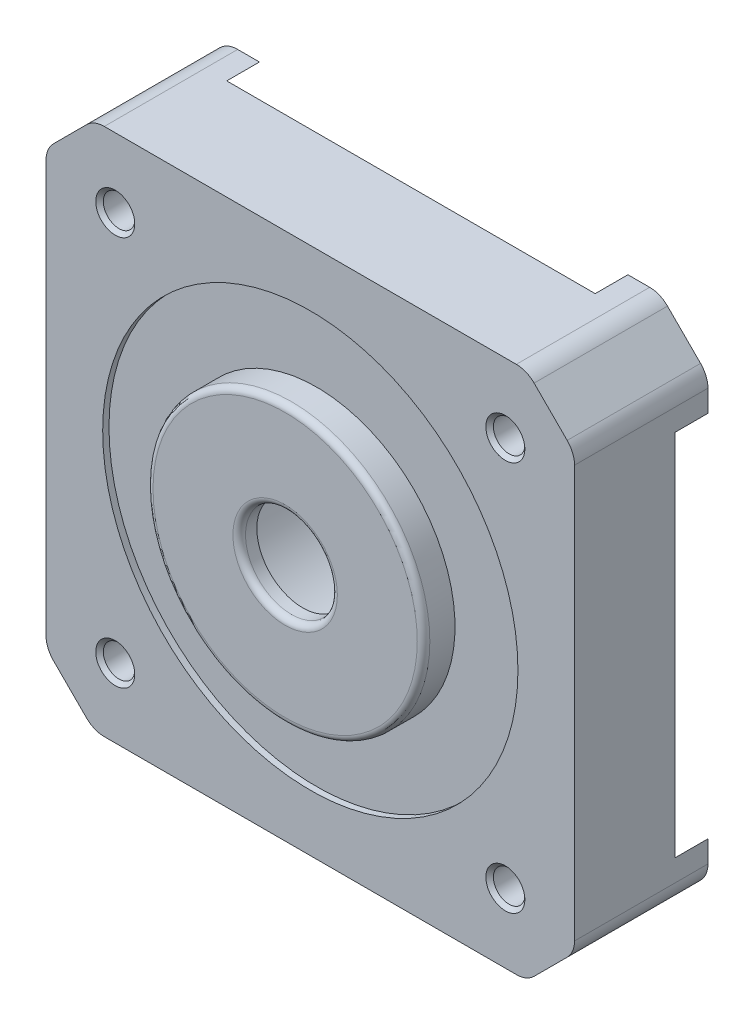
from build123d import *

# Parameters (mm, degrees)
BOSS_EXTRUDE1_DEPTH        = 8
BOSS_EXTRUDE2_DEPTH        = 2.6
BOSS_EXTRUDE3_DEPTH        = 2.6
BOSS_EXTRUDE4_DEPTH        = 2.6
BOSS_EXTRUDE5_DEPTH        = 2.6
M30_CLEARANCE_HOLE1_D      = 33
M30_CLEARANCE_HOLE1_DEPTH  = 10.600025
SKETCH8_W                  = 11
SKETCH8_H                  = 2.5
BOSS_EXTRUDE6_START        = 7.5
SKETCH12_R                 = 16.5
SKETCH12_R_2               = 8
BOSS_EXTRUDE6_DEPTH        = 7.5
F_2_5_2_5_DIAMETER_HOLE1_D = 2.5
FILLET1_R                  = 2
CHAMFER1_SIZE              = 0.3
FILLET3_R                  = 0.5


with BuildPart() as part:
    # Sketch1 → Boss-Extrude1 (new body)
    with BuildSketch(Plane(origin=(0, 0, 34.2), x_dir=(-1, 0, 0), z_dir=(0, 0, -1))):
        Polygon((27.595502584, 125.617151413), (-6.804497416, 125.617151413), (-10.604497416, 121.817151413), (-10.604497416, 87.417151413), (-6.804497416, 83.617151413), (27.595502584, 83.617151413), (31.395502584, 87.417151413), (31.395502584, 121.817151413), align=None)
    extrude(amount=-BOSS_EXTRUDE1_DEPTH)

    # Sketch2 → Boss-Extrude2 (add)
    with BuildSketch(Plane(origin=(0, 0, 34.2), x_dir=(-1, 0, 0), z_dir=(0, 0, -1))):
        with BuildLine():
            Line((-10.604497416, 87.417151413), (-10.604497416, 89.976113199))
            ThreePointArc((-10.604497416, 89.976113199), (-7.706431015, 86.515217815), (-4.245535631, 83.617151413))
            Line((-4.245535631, 83.617151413), (-6.804497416, 83.617151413))
            Line((-6.804497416, 83.617151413), (-10.604497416, 87.417151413))
        make_face()
    extrude(amount=BOSS_EXTRUDE2_DEPTH)

    # Sketch3 → Boss-Extrude3 (add)
    with BuildSketch(Plane(origin=(0, 0, 34.2), x_dir=(-1, 0, 0), z_dir=(0, 0, -1))):
        with BuildLine():
            Line((27.595502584, 83.617151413), (25.036540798, 83.617151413))
            ThreePointArc((25.036540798, 83.617151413), (28.497436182, 86.515217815), (31.395502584, 89.976113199))
            Line((31.395502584, 89.976113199), (31.395502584, 87.417151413))
            Line((31.395502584, 87.417151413), (27.595502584, 83.617151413))
        make_face()
    extrude(amount=BOSS_EXTRUDE3_DEPTH)

    # Sketch4 → Boss-Extrude4 (add)
    with BuildSketch(Plane(origin=(0, 0, 34.2), x_dir=(-1, 0, 0), z_dir=(0, 0, -1))):
        with BuildLine():
            Line((31.395502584, 121.817151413), (31.395502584, 119.258189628))
            ThreePointArc((31.395502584, 119.258189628), (28.497436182, 122.719085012), (25.036540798, 125.617151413))
            Line((25.036540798, 125.617151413), (27.595502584, 125.617151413))
            Line((27.595502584, 125.617151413), (31.395502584, 121.817151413))
        make_face()
    extrude(amount=BOSS_EXTRUDE4_DEPTH)

    # Sketch5 → Boss-Extrude5 (add)
    with BuildSketch(Plane(origin=(0, 0, 34.2), x_dir=(-1, 0, 0), z_dir=(0, 0, -1))):
        with BuildLine():
            Line((-6.804497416, 125.617151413), (-4.245535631, 125.617151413))
            ThreePointArc((-4.245535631, 125.617151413), (-7.706431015, 122.719085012), (-10.604497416, 119.258189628))
            Line((-10.604497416, 119.258189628), (-10.604497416, 121.817151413))
            Line((-10.604497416, 121.817151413), (-6.804497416, 125.617151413))
        make_face()
    extrude(amount=BOSS_EXTRUDE5_DEPTH)

    # M30 Clearance Hole1
    with Locations(Plane.XY.offset(42.2)):
        with Locations((-10.395502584, 104.617151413)):
            Hole(M30_CLEARANCE_HOLE1_D / 2, depth=M30_CLEARANCE_HOLE1_DEPTH)



with BuildPart() as body_2:
    # Sketch8 → Revolve1 (revolve)
    with BuildSketch(Plane.XZ.offset(-104.617151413), mode=Mode.PRIVATE) as revolve1_sk:
        with Locations((-4.895502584, 42.95)):
            Rectangle(SKETCH8_W, SKETCH8_H)
    revolve(revolve1_sk.sketch.rotate(Axis((-10.395502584, 104.617151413, 44.2), (0, 0, -1)), 180), axis=Axis((-10.395502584, 104.617151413, 44.2), (0, 0, -1)))


with BuildPart() as part_1:
    add(part.part)

    add(body_2.part)  # Boss-Extrude6 merges body 2
    # Sketch12 → Boss-Extrude6 (add)
    with BuildSketch(Plane(origin=(0, 0, 41.7), x_dir=(-1, 0, 0), z_dir=(0, 0, -1)).offset(BOSS_EXTRUDE6_START)):
        with Locations(Location((10.395502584, 104.617151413, 0), (0, 0, 180))):
            Circle(SKETCH12_R)
        with Locations((10.395502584, 104.617151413)):
            Circle(SKETCH12_R_2, mode=Mode.SUBTRACT)
    extrude(amount=-BOSS_EXTRUDE6_DEPTH)

    # Sketch9 → Cut-Revolve1 (revolve, cut)
    with BuildSketch(Plane.XZ.offset(-104.617151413), mode=Mode.PRIVATE) as cut_revolve1_sk:
        Polygon((-6.745502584, 44.2), (-10.395502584, 44.2), (-10.395502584, 34.2), (-2.395502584, 34.2), (-2.395502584, 42.8), (-6.745502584, 42.8), align=None)
    revolve(cut_revolve1_sk.sketch.rotate(Axis((-10.395502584, 104.617151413, 44.2), (0, 0, -1)), 180), axis=Axis((-10.395502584, 104.617151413, 44.2), (0, 0, -1)), mode=Mode.SUBTRACT)

    # 2.5 _2.5_ Diameter Hole1 (through all)
    with Locations(Plane.XY.offset(42.2)):
        with Locations((5.104497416, 89.117151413), (5.104497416, 120.117151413), (-25.895502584, 120.117151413), (-25.895502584, 89.117151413)):
            Hole(F_2_5_2_5_DIAMETER_HOLE1_D / 2)

    # Fillet1
    fillet1_edges = [part_1.edges().sort_by_distance(p)[0] for p in [
        (-27.595502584, 125.617151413, 36.9),
        (-31.395502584, 121.817151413, 36.9),
        (-31.395502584, 87.417151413, 36.9),
        (-27.595502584, 83.617151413, 36.9),
        (6.804497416, 83.617151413, 36.9),
        (10.604497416, 87.417151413, 36.9),
        (10.604497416, 121.817151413, 36.9),
        (6.804497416, 125.617151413, 36.9),
    ]]
    fillet(fillet1_edges, radius=FILLET1_R)

    # Chamfer1
    chamfer1_edges = [part_1.edges().sort_by_distance(p)[0] for p in [
        (-24.645502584, 89.117151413, 42.2),
        (-24.645502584, 120.117151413, 42.2),
        (6.354497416, 120.117151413, 42.2),
        (6.354497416, 89.117151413, 42.2),
    ]]
    chamfer(chamfer1_edges, length=CHAMFER1_SIZE)

    # Fillet3
    fillet3_edges = [part_1.edges().sort_by_distance(p)[0] for p in [
        (-6.745502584, 104.617151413, 44.2),
        (0.604497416, 104.617151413, 44.2),
    ]]
    fillet(fillet3_edges, radius=FILLET3_R)


solid = part_1.part
